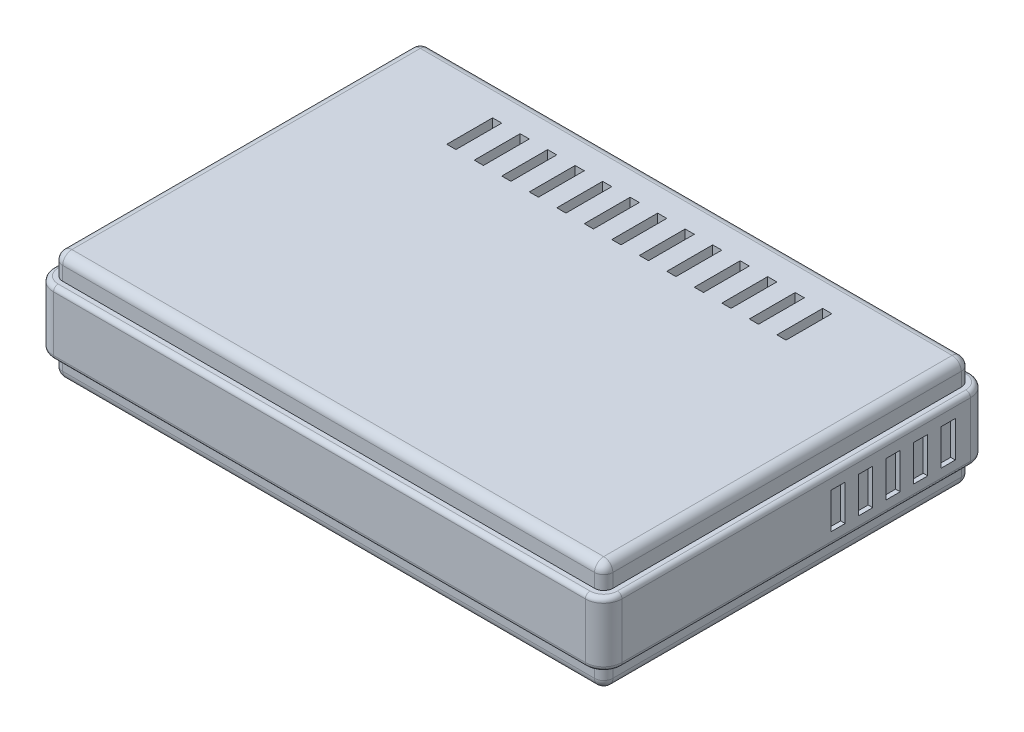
from build123d import *

# Parameters (mm, degrees)
SKETCH1_W          = 152.4
SKETCH1_H          = 101.6
EXTRUDE1_DEPTH     = 15.24
FILLET1_R          = 2.54
EXTRUDE2_DEPTH     = 8.89
FILLET2_R          = 1.27
SKETCH3_W          = 3.890090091
SKETCH3_H          = 9.954054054
CUT_EXTRUDE1_DEPTH = 1.27
SKETCH4_W          = 2.54
SKETCH4_H          = 12.7
CUT_EXTRUDE2_DEPTH = 2.54
SKETCH5_R          = 5.334
CUT_EXTRUDE3_DEPTH = 25.4


with BuildPart() as part:
    # Sketch1 → Extrude1 (new, symmetric)
    with BuildSketch(Plane(origin=(0, 0, 0), x_dir=(1, 0, 0), z_dir=(0, 1, 0))):
        Rectangle(SKETCH1_W, SKETCH1_H)
    extrude(amount=EXTRUDE1_DEPTH, both=True)

    # Fillet1
    fillet1_edges = [part.edges().sort_by_distance(p)[0] for p in [
        (76.2, 15.24, 0),
        (0, 15.24, -50.8),
        (-76.2, 15.24, 0),
        (0, -15.24, -50.8),
        (76.2, -15.24, 0),
        (0, -15.24, 50.8),
        (-76.2, -15.24, 0),
        (0, 15.24, 50.8),
        (-76.2, 0, -50.8),
        (76.2, 0, -50.8),
        (76.2, 0, 50.8),
        (-76.2, 0, 50.8),
    ]]
    fillet(fillet1_edges, radius=FILLET1_R)

    # Sketch2 → Extrude2 (add, symmetric)
    with BuildSketch(Plane(origin=(0, 0, 0), x_dir=(1, 0, 0), z_dir=(0, 1, 0))):
        with BuildLine():
            Line((78.74, -48.26), (78.74, 48.26))
            ThreePointArc((78.74, 48.26), (77.252102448, 51.852102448), (73.66, 53.34))
            Line((73.66, 53.34), (-73.66, 53.34))
            ThreePointArc((-73.66, 53.34), (-77.252102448, 51.852102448), (-78.74, 48.26))
            Line((-78.74, 48.26), (-78.74, -48.26))
            ThreePointArc((-78.74, -48.26), (-77.252102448, -51.852102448), (-73.66, -53.34))
            Line((-73.66, -53.34), (73.66, -53.34))
            ThreePointArc((73.66, -53.34), (77.252102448, -51.852102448), (78.74, -48.26))
        make_face()
    extrude(amount=EXTRUDE2_DEPTH, both=True)

    # Fillet2
    fillet2_edges = [part.edges().sort_by_distance(p)[0] for p in [
        (77.252102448, -8.89, -51.852102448),
        (0, -8.89, -53.34),
        (-77.252102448, -8.89, -51.852102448),
        (-78.74, -8.89, 0),
        (-77.252102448, -8.89, 51.852102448),
        (0, -8.89, 53.34),
        (77.252102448, -8.89, 51.852102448),
        (78.74, -8.89, 0),
        (77.252102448, 8.89, -51.852102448),
        (0, 8.89, -53.34),
        (-77.252102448, 8.89, -51.852102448),
        (-78.74, 8.89, 0),
        (-77.252102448, 8.89, 51.852102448),
        (0, 8.89, 53.34),
        (77.252102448, 8.89, 51.852102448),
        (78.74, 8.89, 0),
    ]]
    fillet(fillet2_edges, radius=FILLET2_R)

    # Sketch3 → Cut-Extrude1 (cut)
    with BuildSketch(Plane(origin=(78.74, 0, 0), x_dir=(0, 0, -1), z_dir=(1, 0, 0))):
        with Locations((34.484504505, -0.228828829)):
            Rectangle(SKETCH3_W, SKETCH3_H)
        with Locations((42.104504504, -0.228828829)):
            Rectangle(SKETCH3_W, SKETCH3_H)
        with Locations((26.864504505, -0.228828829)):
            Rectangle(SKETCH3_W, SKETCH3_H)
        with Locations((19.244504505, -0.228828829)):
            Rectangle(SKETCH3_W, SKETCH3_H)
        with Locations((11.624504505, -0.228828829)):
            Rectangle(SKETCH3_W, SKETCH3_H)
    cut_extrude1 = extrude(amount=-CUT_EXTRUDE1_DEPTH, mode=Mode.SUBTRACT)

    # Mirror1: Cut-Extrude1 across plane
    add(cut_extrude1.mirror(Plane(origin=(0, 0, 0), x_dir=(0, 0, 1), z_dir=(1, 0, 0))), mode=Mode.SUBTRACT)

    # Sketch4 → Cut-Extrude2 (cut)
    with BuildSketch(Plane(origin=(0, 15.24, 0), x_dir=(1, 0, 0), z_dir=(0, 1, 0))):
        with Locations((-7.62, 35.266273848)):
            Rectangle(SKETCH4_W, SKETCH4_H)
        with Locations((0, 35.266273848)):
            Rectangle(SKETCH4_W, SKETCH4_H)
        with Locations((-15.24, 35.266273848)):
            Rectangle(SKETCH4_W, SKETCH4_H)
        with Locations((-22.86, 35.266273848)):
            Rectangle(SKETCH4_W, SKETCH4_H)
        with Locations((-30.48, 35.266273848)):
            Rectangle(SKETCH4_W, SKETCH4_H)
        with Locations((-38.1, 35.266273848)):
            Rectangle(SKETCH4_W, SKETCH4_H)
        with Locations((-45.72, 35.266273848)):
            Rectangle(SKETCH4_W, SKETCH4_H)
        with Locations((7.62, 35.266273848)):
            Rectangle(SKETCH4_W, SKETCH4_H)
        with Locations((15.24, 35.266273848)):
            Rectangle(SKETCH4_W, SKETCH4_H)
        with Locations((22.86, 35.266273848)):
            Rectangle(SKETCH4_W, SKETCH4_H)
        with Locations((30.48, 35.266273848)):
            Rectangle(SKETCH4_W, SKETCH4_H)
        with Locations((38.1, 35.266273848)):
            Rectangle(SKETCH4_W, SKETCH4_H)
        with Locations((45.72, 35.266273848)):
            Rectangle(SKETCH4_W, SKETCH4_H)
    extrude(amount=-CUT_EXTRUDE2_DEPTH, mode=Mode.SUBTRACT)

    # Sketch5 → Cut-Extrude3 (cut)
    with BuildSketch(Plane(origin=(0, 0, -53.34), x_dir=(-1, 0, 0), z_dir=(0, 0, -1))):
        with Locations((-46.109009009, 0)):
            Circle(SKETCH5_R)
        with Locations((12.723638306, 0)):
            Circle(SKETCH5_R)
        with Locations((43.744444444, 0)):
            Circle(SKETCH5_R)
    extrude(amount=-CUT_EXTRUDE3_DEPTH, mode=Mode.SUBTRACT)


solid = part.part
